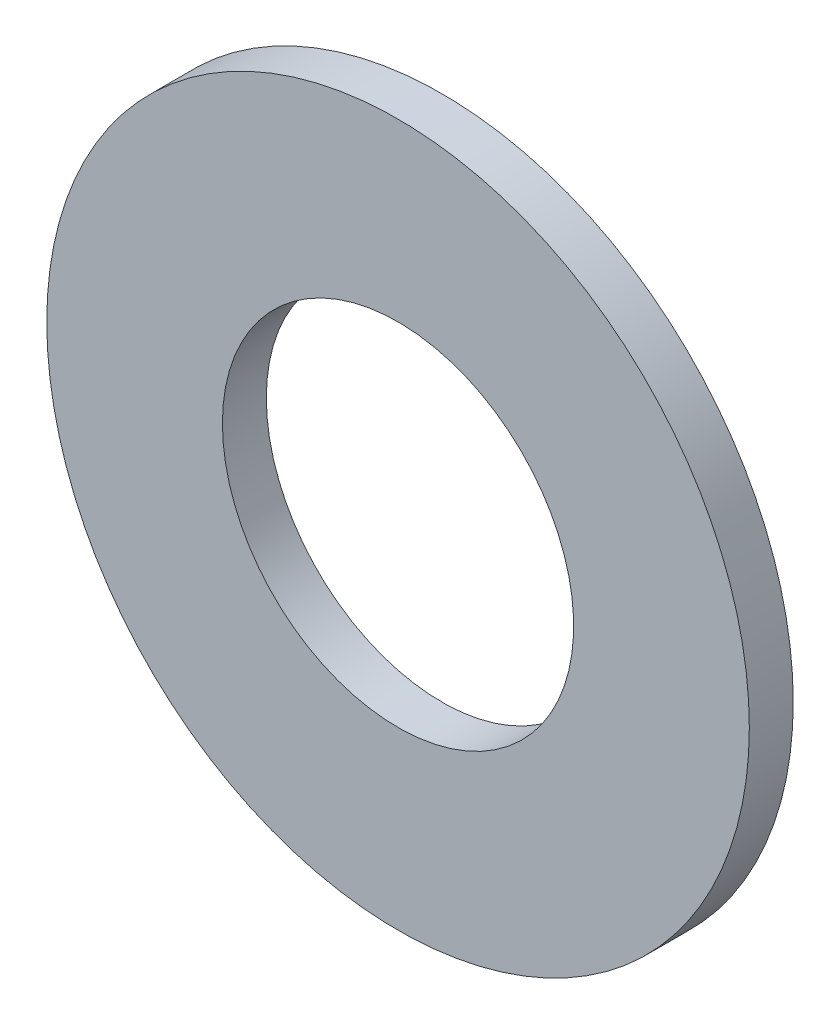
from build123d import *

# Parameters (mm, degrees)
ESQUISSE2_R          = 4
ESQUISSE2_R_2        = 2
BASE_EXTRUSION_DEPTH = 0.5


with BuildPart() as part:
    # Esquisse2 → Base-Extrusion (new body)
    with BuildSketch(Plane(origin=(0, 0, 1), x_dir=(-1, 0, 0), z_dir=(0, 0, -1))):
        with Locations((-11.368861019, 14.538020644)):
            Circle(ESQUISSE2_R)
        with Locations((-11.368861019, 14.538020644)):
            Circle(ESQUISSE2_R_2, mode=Mode.SUBTRACT)
    extrude(amount=-BASE_EXTRUSION_DEPTH)


solid = part.part
